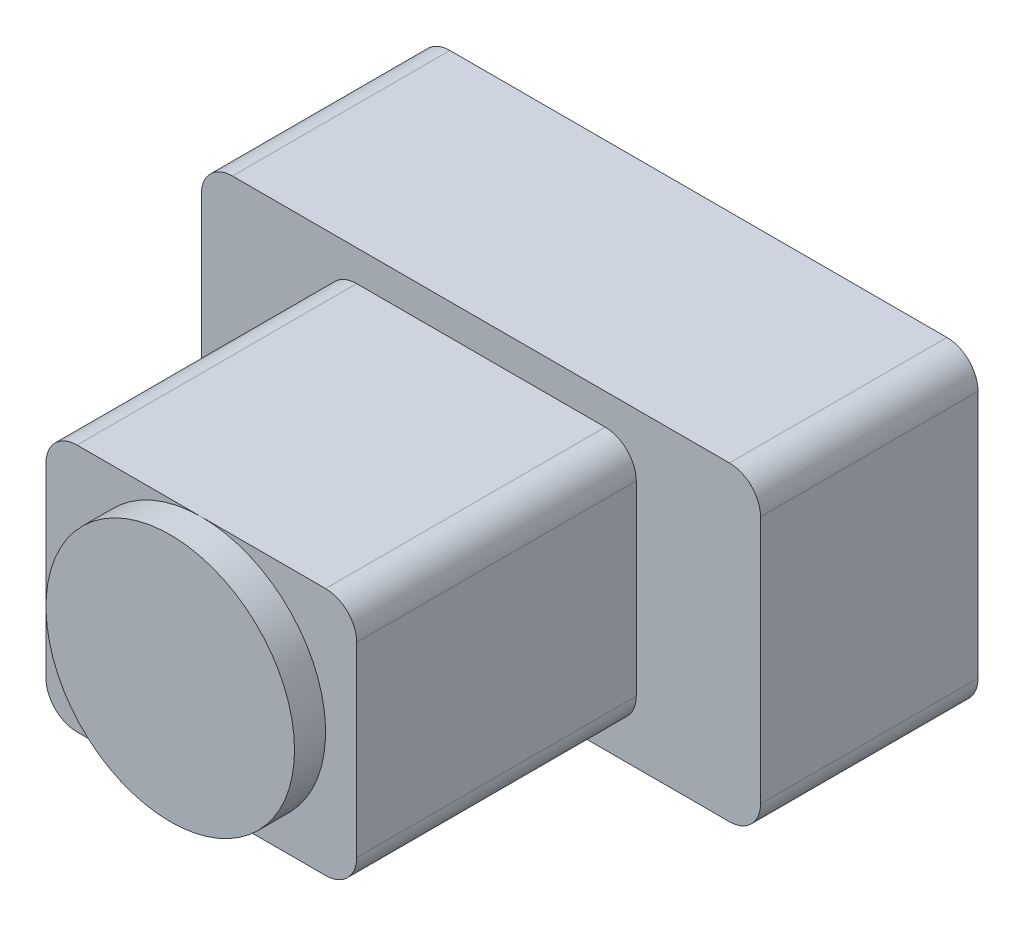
ISO-10303-21;
HEADER;
FILE_DESCRIPTION(('STEP AP214'),'2;1');
FILE_NAME('part.step','',(''),(''),'','','');
FILE_SCHEMA(('AUTOMOTIVE_DESIGN { 1 0 10303 214 1 1 1 1 }'));
ENDSEC;
DATA;
#1=APPLICATION_CONTEXT('core data for automotive mechanical design processes');
#2=APPLICATION_PROTOCOL_DEFINITION('international standard','automotive_design',2000,#1);
#3=PRODUCT_CONTEXT('',#1,'mechanical');
#4=PRODUCT('Part','Part','',(#3));
#5=PRODUCT_RELATED_PRODUCT_CATEGORY('part','',(#4));
#6=PRODUCT_DEFINITION_FORMATION('','',#4);
#7=PRODUCT_DEFINITION_CONTEXT('part definition',#1,'design');
#8=PRODUCT_DEFINITION('design','',#6,#7);
#9=PRODUCT_DEFINITION_SHAPE('','',#8);
#10=(LENGTH_UNIT() NAMED_UNIT(*) SI_UNIT(.MILLI.,.METRE.));
#11=(NAMED_UNIT(*) PLANE_ANGLE_UNIT() SI_UNIT($,.RADIAN.));
#12=(NAMED_UNIT(*) SI_UNIT($,.STERADIAN.) SOLID_ANGLE_UNIT());
#13=UNCERTAINTY_MEASURE_WITH_UNIT(LENGTH_MEASURE(1.E-05),#10,'distance_accuracy_value','');
#14=(GEOMETRIC_REPRESENTATION_CONTEXT(3) GLOBAL_UNCERTAINTY_ASSIGNED_CONTEXT((#13)) GLOBAL_UNIT_ASSIGNED_CONTEXT((#10,
#11,#12)) REPRESENTATION_CONTEXT('',''));
#15=CARTESIAN_POINT('',(0.,0.,0.));
#16=DIRECTION('',(0.,0.,1.));
#17=DIRECTION('',(1.,0.,0.));
#18=AXIS2_PLACEMENT_3D('',#15,#16,#17);
#19=CARTESIAN_POINT('',(-20.,-15.,80.));
#20=DIRECTION('',(0.,0.,1.));
#21=DIRECTION('',(1.,0.,0.));
#22=AXIS2_PLACEMENT_3D('',#19,#20,#21);
#23=PLANE('',#22);
#24=CARTESIAN_POINT('',(0.,0.,80.));
#25=DIRECTION('',(0.,0.,1.));
#26=DIRECTION('',(1.,0.,0.));
#27=AXIS2_PLACEMENT_3D('',#24,#25,#26);
#28=CIRCLE('',#27,20.);
#29=CARTESIAN_POINT('',(0.,20.,80.));
#30=VERTEX_POINT('',#29);
#31=CARTESIAN_POINT('',(0.,-20.,80.));
#32=VERTEX_POINT('',#31);
#33=EDGE_CURVE('E45',#30,#32,#28,.T.);
#34=ORIENTED_EDGE('',*,*,#33,.F.);
#35=DIRECTION('',(-1.,0.,0.));
#36=VECTOR('',#35,1.);
#37=CARTESIAN_POINT('',(-20.,20.,80.));
#38=LINE('',#37,#36);
#39=CARTESIAN_POINT('',(-20.,20.,80.));
#40=VERTEX_POINT('',#39);
#41=EDGE_CURVE('E161',#30,#40,#38,.T.);
#42=ORIENTED_EDGE('',*,*,#41,.T.);
#43=CARTESIAN_POINT('',(-20.,15.,80.));
#44=DIRECTION('',(0.,0.,1.));
#45=DIRECTION('',(1.,0.,0.));
#46=AXIS2_PLACEMENT_3D('',#43,#44,#45);
#47=CIRCLE('',#46,5.);
#48=CARTESIAN_POINT('',(-25.,15.,80.));
#49=VERTEX_POINT('',#48);
#50=EDGE_CURVE('E160',#40,#49,#47,.T.);
#51=ORIENTED_EDGE('',*,*,#50,.T.);
#52=DIRECTION('',(0.,-1.,0.));
#53=VECTOR('',#52,1.);
#54=CARTESIAN_POINT('',(-25.,15.,80.));
#55=LINE('',#54,#53);
#56=CARTESIAN_POINT('',(-25.,-15.,80.));
#57=VERTEX_POINT('',#56);
#58=EDGE_CURVE('E364',#49,#57,#55,.T.);
#59=ORIENTED_EDGE('',*,*,#58,.T.);
#60=CARTESIAN_POINT('',(-20.,-15.,80.));
#61=DIRECTION('',(0.,0.,1.));
#62=DIRECTION('',(1.,0.,0.));
#63=AXIS2_PLACEMENT_3D('',#60,#61,#62);
#64=CIRCLE('',#63,5.);
#65=CARTESIAN_POINT('',(-20.,-20.,80.));
#66=VERTEX_POINT('',#65);
#67=EDGE_CURVE('E361',#57,#66,#64,.T.);
#68=ORIENTED_EDGE('',*,*,#67,.T.);
#69=DIRECTION('',(1.,0.,0.));
#70=VECTOR('',#69,1.);
#71=CARTESIAN_POINT('',(-20.,-20.,80.));
#72=LINE('',#71,#70);
#73=EDGE_CURVE('E174',#66,#32,#72,.T.);
#74=ORIENTED_EDGE('',*,*,#73,.T.);
#75=EDGE_LOOP('',(#34,#42,#51,#59,#68,#74));
#76=FACE_BOUND('',#75,.T.);
#77=ADVANCED_FACE('F35',(#76),#23,.T.);
#78=CARTESIAN_POINT('',(40.,20.,35.));
#79=DIRECTION('',(0.,0.,-1.));
#80=DIRECTION('',(-1.,0.,0.));
#81=AXIS2_PLACEMENT_3D('',#78,#79,#80);
#82=PLANE('',#81);
#83=CARTESIAN_POINT('',(40.,20.,35.));
#84=DIRECTION('',(0.,0.,1.));
#85=DIRECTION('',(-1.,0.,0.));
#86=AXIS2_PLACEMENT_3D('',#83,#84,#85);
#87=CIRCLE('',#86,5.);
#88=CARTESIAN_POINT('',(45.,20.,35.));
#89=VERTEX_POINT('',#88);
#90=CARTESIAN_POINT('',(40.,25.,35.));
#91=VERTEX_POINT('',#90);
#92=EDGE_CURVE('E294',#89,#91,#87,.T.);
#93=ORIENTED_EDGE('',*,*,#92,.T.);
#94=DIRECTION('',(-1.,0.,0.));
#95=VECTOR('',#94,1.);
#96=CARTESIAN_POINT('',(-40.,25.,35.));
#97=LINE('',#96,#95);
#98=CARTESIAN_POINT('',(-40.,25.,35.));
#99=VERTEX_POINT('',#98);
#100=EDGE_CURVE('E319',#91,#99,#97,.T.);
#101=ORIENTED_EDGE('',*,*,#100,.T.);
#102=CARTESIAN_POINT('',(-40.,20.,35.));
#103=DIRECTION('',(0.,0.,1.));
#104=DIRECTION('',(1.,0.,0.));
#105=AXIS2_PLACEMENT_3D('',#102,#103,#104);
#106=CIRCLE('',#105,5.);
#107=CARTESIAN_POINT('',(-45.,20.,35.));
#108=VERTEX_POINT('',#107);
#109=EDGE_CURVE('E277',#99,#108,#106,.T.);
#110=ORIENTED_EDGE('',*,*,#109,.T.);
#111=DIRECTION('',(0.,-1.,0.));
#112=VECTOR('',#111,1.);
#113=CARTESIAN_POINT('',(-45.,20.,35.));
#114=LINE('',#113,#112);
#115=CARTESIAN_POINT('',(-45.,-20.,35.));
#116=VERTEX_POINT('',#115);
#117=EDGE_CURVE('E313',#108,#116,#114,.T.);
#118=ORIENTED_EDGE('',*,*,#117,.T.);
#119=CARTESIAN_POINT('',(-40.,-20.,35.));
#120=DIRECTION('',(0.,0.,1.));
#121=DIRECTION('',(1.,0.,0.));
#122=AXIS2_PLACEMENT_3D('',#119,#120,#121);
#123=CIRCLE('',#122,5.);
#124=CARTESIAN_POINT('',(-40.,-25.,35.));
#125=VERTEX_POINT('',#124);
#126=EDGE_CURVE('E315',#116,#125,#123,.T.);
#127=ORIENTED_EDGE('',*,*,#126,.T.);
#128=DIRECTION('',(1.,0.,0.));
#129=VECTOR('',#128,1.);
#130=CARTESIAN_POINT('',(-40.,-25.,35.));
#131=LINE('',#130,#129);
#132=CARTESIAN_POINT('',(40.,-25.,35.));
#133=VERTEX_POINT('',#132);
#134=EDGE_CURVE('E317',#125,#133,#131,.T.);
#135=ORIENTED_EDGE('',*,*,#134,.T.);
#136=CARTESIAN_POINT('',(40.,-20.,35.));
#137=DIRECTION('',(0.,0.,1.));
#138=DIRECTION('',(1.,0.,0.));
#139=AXIS2_PLACEMENT_3D('',#136,#137,#138);
#140=CIRCLE('',#139,5.);
#141=CARTESIAN_POINT('',(45.,-20.,35.));
#142=VERTEX_POINT('',#141);
#143=EDGE_CURVE('E324',#133,#142,#140,.T.);
#144=ORIENTED_EDGE('',*,*,#143,.T.);
#145=DIRECTION('',(0.,1.,0.));
#146=VECTOR('',#145,1.);
#147=CARTESIAN_POINT('',(45.,20.,35.));
#148=LINE('',#147,#146);
#149=EDGE_CURVE('E299',#142,#89,#148,.T.);
#150=ORIENTED_EDGE('',*,*,#149,.T.);
#151=EDGE_LOOP('',(#93,#101,#110,#118,#127,#135,#144,#150));
#152=FACE_BOUND('',#151,.T.);
#153=CARTESIAN_POINT('',(-20.,-15.,35.));
#154=DIRECTION('',(0.,0.,1.));
#155=DIRECTION('',(1.,0.,0.));
#156=AXIS2_PLACEMENT_3D('',#153,#154,#155);
#157=CIRCLE('',#156,5.);
#158=CARTESIAN_POINT('',(-25.,-15.,35.));
#159=VERTEX_POINT('',#158);
#160=CARTESIAN_POINT('',(-20.,-20.,35.));
#161=VERTEX_POINT('',#160);
#162=EDGE_CURVE('E348',#159,#161,#157,.T.);
#163=ORIENTED_EDGE('',*,*,#162,.F.);
#164=DIRECTION('',(0.,-1.,0.));
#165=VECTOR('',#164,1.);
#166=CARTESIAN_POINT('',(-25.,15.,35.));
#167=LINE('',#166,#165);
#168=CARTESIAN_POINT('',(-25.,15.,35.));
#169=VERTEX_POINT('',#168);
#170=EDGE_CURVE('E350',#169,#159,#167,.T.);
#171=ORIENTED_EDGE('',*,*,#170,.F.);
#172=CARTESIAN_POINT('',(-20.,15.,35.));
#173=DIRECTION('',(0.,0.,1.));
#174=DIRECTION('',(1.,0.,0.));
#175=AXIS2_PLACEMENT_3D('',#172,#173,#174);
#176=CIRCLE('',#175,5.);
#177=CARTESIAN_POINT('',(-20.,20.,35.));
#178=VERTEX_POINT('',#177);
#179=EDGE_CURVE('E362',#178,#169,#176,.T.);
#180=ORIENTED_EDGE('',*,*,#179,.F.);
#181=DIRECTION('',(-1.,0.,0.));
#182=VECTOR('',#181,1.);
#183=CARTESIAN_POINT('',(-20.,20.,35.));
#184=LINE('',#183,#182);
#185=CARTESIAN_POINT('',(20.,20.,35.));
#186=VERTEX_POINT('',#185);
#187=EDGE_CURVE('E394',#186,#178,#184,.T.);
#188=ORIENTED_EDGE('',*,*,#187,.F.);
#189=CARTESIAN_POINT('',(20.,15.,35.));
#190=DIRECTION('',(0.,0.,1.));
#191=DIRECTION('',(-1.,0.,0.));
#192=AXIS2_PLACEMENT_3D('',#189,#190,#191);
#193=CIRCLE('',#192,5.);
#194=CARTESIAN_POINT('',(25.,15.,35.));
#195=VERTEX_POINT('',#194);
#196=EDGE_CURVE('E388',#195,#186,#193,.T.);
#197=ORIENTED_EDGE('',*,*,#196,.F.);
#198=DIRECTION('',(0.,1.,0.));
#199=VECTOR('',#198,1.);
#200=CARTESIAN_POINT('',(25.,15.,35.));
#201=LINE('',#200,#199);
#202=CARTESIAN_POINT('',(25.,-15.,35.));
#203=VERTEX_POINT('',#202);
#204=EDGE_CURVE('E380',#203,#195,#201,.T.);
#205=ORIENTED_EDGE('',*,*,#204,.F.);
#206=CARTESIAN_POINT('',(20.,-15.,35.));
#207=DIRECTION('',(0.,0.,1.));
#208=DIRECTION('',(1.,0.,0.));
#209=AXIS2_PLACEMENT_3D('',#206,#207,#208);
#210=CIRCLE('',#209,5.);
#211=CARTESIAN_POINT('',(20.,-20.,35.));
#212=VERTEX_POINT('',#211);
#213=EDGE_CURVE('E385',#212,#203,#210,.T.);
#214=ORIENTED_EDGE('',*,*,#213,.F.);
#215=DIRECTION('',(1.,0.,0.));
#216=VECTOR('',#215,1.);
#217=CARTESIAN_POINT('',(-20.,-20.,35.));
#218=LINE('',#217,#216);
#219=EDGE_CURVE('E58',#161,#212,#218,.T.);
#220=ORIENTED_EDGE('',*,*,#219,.F.);
#221=EDGE_LOOP('',(#163,#171,#180,#188,#197,#205,#214,#220));
#222=FACE_BOUND('',#221,.T.);
#223=ADVANCED_FACE('F192',(#152,#222),#82,.F.);
#224=CARTESIAN_POINT('',(40.,20.,35.));
#225=DIRECTION('',(0.,0.,-1.));
#226=DIRECTION('',(-1.,0.,0.));
#227=AXIS2_PLACEMENT_3D('',#224,#225,#226);
#228=CYLINDRICAL_SURFACE('',#227,5.);
#229=CARTESIAN_POINT('',(40.,20.,0.));
#230=DIRECTION('',(0.,0.,1.));
#231=DIRECTION('',(-1.,0.,0.));
#232=AXIS2_PLACEMENT_3D('',#229,#230,#231);
#233=CIRCLE('',#232,5.);
#234=CARTESIAN_POINT('',(45.,20.,0.));
#235=VERTEX_POINT('',#234);
#236=CARTESIAN_POINT('',(40.,25.,0.));
#237=VERTEX_POINT('',#236);
#238=EDGE_CURVE('E273',#235,#237,#233,.T.);
#239=ORIENTED_EDGE('',*,*,#238,.T.);
#240=DIRECTION('',(0.,0.,-1.));
#241=VECTOR('',#240,1.);
#242=CARTESIAN_POINT('',(40.,25.,35.));
#243=LINE('',#242,#241);
#244=EDGE_CURVE('E39',#91,#237,#243,.T.);
#245=ORIENTED_EDGE('',*,*,#244,.F.);
#246=ORIENTED_EDGE('',*,*,#92,.F.);
#247=DIRECTION('',(0.,0.,-1.));
#248=VECTOR('',#247,1.);
#249=CARTESIAN_POINT('',(45.,20.,35.));
#250=LINE('',#249,#248);
#251=EDGE_CURVE('E295',#89,#235,#250,.T.);
#252=ORIENTED_EDGE('',*,*,#251,.T.);
#253=EDGE_LOOP('',(#239,#245,#246,#252));
#254=FACE_BOUND('',#253,.T.);
#255=ADVANCED_FACE('F37',(#254),#228,.T.);
#256=CARTESIAN_POINT('',(-40.,25.,35.));
#257=DIRECTION('',(0.,-1.,0.));
#258=DIRECTION('',(0.,0.,-1.));
#259=AXIS2_PLACEMENT_3D('',#256,#257,#258);
#260=PLANE('',#259);
#261=DIRECTION('',(-1.,0.,0.));
#262=VECTOR('',#261,1.);
#263=CARTESIAN_POINT('',(-40.,25.,0.));
#264=LINE('',#263,#262);
#265=CARTESIAN_POINT('',(-40.,25.,0.));
#266=VERTEX_POINT('',#265);
#267=EDGE_CURVE('E264',#237,#266,#264,.T.);
#268=ORIENTED_EDGE('',*,*,#267,.T.);
#269=DIRECTION('',(0.,0.,-1.));
#270=VECTOR('',#269,1.);
#271=CARTESIAN_POINT('',(-40.,25.,35.));
#272=LINE('',#271,#270);
#273=EDGE_CURVE('E266',#99,#266,#272,.T.);
#274=ORIENTED_EDGE('',*,*,#273,.F.);
#275=ORIENTED_EDGE('',*,*,#100,.F.);
#276=ORIENTED_EDGE('',*,*,#244,.T.);
#277=EDGE_LOOP('',(#268,#274,#275,#276));
#278=FACE_BOUND('',#277,.T.);
#279=ADVANCED_FACE('F254',(#278),#260,.F.);
#280=CARTESIAN_POINT('',(-40.,20.,35.));
#281=DIRECTION('',(0.,0.,-1.));
#282=DIRECTION('',(-1.,0.,0.));
#283=AXIS2_PLACEMENT_3D('',#280,#281,#282);
#284=CYLINDRICAL_SURFACE('',#283,5.);
#285=CARTESIAN_POINT('',(-40.,20.,0.));
#286=DIRECTION('',(0.,0.,1.));
#287=DIRECTION('',(1.,0.,0.));
#288=AXIS2_PLACEMENT_3D('',#285,#286,#287);
#289=CIRCLE('',#288,5.);
#290=CARTESIAN_POINT('',(-45.,20.,0.));
#291=VERTEX_POINT('',#290);
#292=EDGE_CURVE('E272',#266,#291,#289,.T.);
#293=ORIENTED_EDGE('',*,*,#292,.T.);
#294=DIRECTION('',(0.,0.,-1.));
#295=VECTOR('',#294,1.);
#296=CARTESIAN_POINT('',(-45.,20.,35.));
#297=LINE('',#296,#295);
#298=EDGE_CURVE('E278',#108,#291,#297,.T.);
#299=ORIENTED_EDGE('',*,*,#298,.F.);
#300=ORIENTED_EDGE('',*,*,#109,.F.);
#301=ORIENTED_EDGE('',*,*,#273,.T.);
#302=EDGE_LOOP('',(#293,#299,#300,#301));
#303=FACE_BOUND('',#302,.T.);
#304=ADVANCED_FACE('F251',(#303),#284,.T.);
#305=CARTESIAN_POINT('',(-45.,20.,35.));
#306=DIRECTION('',(1.,0.,0.));
#307=DIRECTION('',(0.,1.,0.));
#308=AXIS2_PLACEMENT_3D('',#305,#306,#307);
#309=PLANE('',#308);
#310=DIRECTION('',(0.,-1.,0.));
#311=VECTOR('',#310,1.);
#312=CARTESIAN_POINT('',(-45.,20.,0.));
#313=LINE('',#312,#311);
#314=CARTESIAN_POINT('',(-45.,-20.,0.));
#315=VERTEX_POINT('',#314);
#316=EDGE_CURVE('E281',#291,#315,#313,.T.);
#317=ORIENTED_EDGE('',*,*,#316,.T.);
#318=DIRECTION('',(0.,0.,-1.));
#319=VECTOR('',#318,1.);
#320=CARTESIAN_POINT('',(-45.,-20.,35.));
#321=LINE('',#320,#319);
#322=EDGE_CURVE('E308',#116,#315,#321,.T.);
#323=ORIENTED_EDGE('',*,*,#322,.F.);
#324=ORIENTED_EDGE('',*,*,#117,.F.);
#325=ORIENTED_EDGE('',*,*,#298,.T.);
#326=EDGE_LOOP('',(#317,#323,#324,#325));
#327=FACE_BOUND('',#326,.T.);
#328=ADVANCED_FACE('F247',(#327),#309,.F.);
#329=CARTESIAN_POINT('',(-40.,-20.,35.));
#330=DIRECTION('',(0.,0.,-1.));
#331=DIRECTION('',(-1.,0.,0.));
#332=AXIS2_PLACEMENT_3D('',#329,#330,#331);
#333=CYLINDRICAL_SURFACE('',#332,5.);
#334=CARTESIAN_POINT('',(-40.,-20.,0.));
#335=DIRECTION('',(0.,0.,1.));
#336=DIRECTION('',(1.,0.,0.));
#337=AXIS2_PLACEMENT_3D('',#334,#335,#336);
#338=CIRCLE('',#337,5.);
#339=CARTESIAN_POINT('',(-40.,-25.,0.));
#340=VERTEX_POINT('',#339);
#341=EDGE_CURVE('E283',#315,#340,#338,.T.);
#342=ORIENTED_EDGE('',*,*,#341,.T.);
#343=DIRECTION('',(0.,0.,-1.));
#344=VECTOR('',#343,1.);
#345=CARTESIAN_POINT('',(-40.,-25.,35.));
#346=LINE('',#345,#344);
#347=EDGE_CURVE('E305',#125,#340,#346,.T.);
#348=ORIENTED_EDGE('',*,*,#347,.F.);
#349=ORIENTED_EDGE('',*,*,#126,.F.);
#350=ORIENTED_EDGE('',*,*,#322,.T.);
#351=EDGE_LOOP('',(#342,#348,#349,#350));
#352=FACE_BOUND('',#351,.T.);
#353=ADVANCED_FACE('F243',(#352),#333,.T.);
#354=CARTESIAN_POINT('',(-40.,-25.,35.));
#355=DIRECTION('',(0.,1.,0.));
#356=DIRECTION('',(0.,0.,1.));
#357=AXIS2_PLACEMENT_3D('',#354,#355,#356);
#358=PLANE('',#357);
#359=DIRECTION('',(1.,0.,0.));
#360=VECTOR('',#359,1.);
#361=CARTESIAN_POINT('',(-40.,-25.,0.));
#362=LINE('',#361,#360);
#363=CARTESIAN_POINT('',(40.,-25.,0.));
#364=VERTEX_POINT('',#363);
#365=EDGE_CURVE('E288',#340,#364,#362,.T.);
#366=ORIENTED_EDGE('',*,*,#365,.T.);
#367=DIRECTION('',(0.,0.,-1.));
#368=VECTOR('',#367,1.);
#369=CARTESIAN_POINT('',(40.,-25.,35.));
#370=LINE('',#369,#368);
#371=EDGE_CURVE('E302',#133,#364,#370,.T.);
#372=ORIENTED_EDGE('',*,*,#371,.F.);
#373=ORIENTED_EDGE('',*,*,#134,.F.);
#374=ORIENTED_EDGE('',*,*,#347,.T.);
#375=EDGE_LOOP('',(#366,#372,#373,#374));
#376=FACE_BOUND('',#375,.T.);
#377=ADVANCED_FACE('F239',(#376),#358,.F.);
#378=CARTESIAN_POINT('',(40.,-20.,35.));
#379=DIRECTION('',(0.,0.,-1.));
#380=DIRECTION('',(-1.,0.,0.));
#381=AXIS2_PLACEMENT_3D('',#378,#379,#380);
#382=CYLINDRICAL_SURFACE('',#381,5.);
#383=CARTESIAN_POINT('',(40.,-20.,0.));
#384=DIRECTION('',(0.,0.,1.));
#385=DIRECTION('',(1.,0.,0.));
#386=AXIS2_PLACEMENT_3D('',#383,#384,#385);
#387=CIRCLE('',#386,5.);
#388=CARTESIAN_POINT('',(45.,-20.,0.));
#389=VERTEX_POINT('',#388);
#390=EDGE_CURVE('E290',#364,#389,#387,.T.);
#391=ORIENTED_EDGE('',*,*,#390,.T.);
#392=DIRECTION('',(0.,0.,-1.));
#393=VECTOR('',#392,1.);
#394=CARTESIAN_POINT('',(45.,-20.,35.));
#395=LINE('',#394,#393);
#396=EDGE_CURVE('E298',#142,#389,#395,.T.);
#397=ORIENTED_EDGE('',*,*,#396,.F.);
#398=ORIENTED_EDGE('',*,*,#143,.F.);
#399=ORIENTED_EDGE('',*,*,#371,.T.);
#400=EDGE_LOOP('',(#391,#397,#398,#399));
#401=FACE_BOUND('',#400,.T.);
#402=ADVANCED_FACE('F235',(#401),#382,.T.);
#403=CARTESIAN_POINT('',(45.,20.,35.));
#404=DIRECTION('',(-1.,0.,0.));
#405=DIRECTION('',(0.,-1.,0.));
#406=AXIS2_PLACEMENT_3D('',#403,#404,#405);
#407=PLANE('',#406);
#408=DIRECTION('',(0.,1.,0.));
#409=VECTOR('',#408,1.);
#410=CARTESIAN_POINT('',(45.,20.,0.));
#411=LINE('',#410,#409);
#412=EDGE_CURVE('E292',#389,#235,#411,.T.);
#413=ORIENTED_EDGE('',*,*,#412,.T.);
#414=ORIENTED_EDGE('',*,*,#251,.F.);
#415=ORIENTED_EDGE('',*,*,#149,.F.);
#416=ORIENTED_EDGE('',*,*,#396,.T.);
#417=EDGE_LOOP('',(#413,#414,#415,#416));
#418=FACE_BOUND('',#417,.T.);
#419=ADVANCED_FACE('F231',(#418),#407,.F.);
#420=CARTESIAN_POINT('',(40.,20.,0.));
#421=DIRECTION('',(0.,0.,-1.));
#422=DIRECTION('',(-1.,0.,0.));
#423=AXIS2_PLACEMENT_3D('',#420,#421,#422);
#424=PLANE('',#423);
#425=ORIENTED_EDGE('',*,*,#238,.F.);
#426=ORIENTED_EDGE('',*,*,#412,.F.);
#427=ORIENTED_EDGE('',*,*,#390,.F.);
#428=ORIENTED_EDGE('',*,*,#365,.F.);
#429=ORIENTED_EDGE('',*,*,#341,.F.);
#430=ORIENTED_EDGE('',*,*,#316,.F.);
#431=ORIENTED_EDGE('',*,*,#292,.F.);
#432=ORIENTED_EDGE('',*,*,#267,.F.);
#433=EDGE_LOOP('',(#425,#426,#427,#428,#429,#430,#431,#432));
#434=FACE_BOUND('',#433,.T.);
#435=ADVANCED_FACE('F226',(#434),#424,.T.);
#436=CARTESIAN_POINT('',(-20.,-15.,80.));
#437=DIRECTION('',(0.,0.,-1.));
#438=DIRECTION('',(-1.,0.,0.));
#439=AXIS2_PLACEMENT_3D('',#436,#437,#438);
#440=CYLINDRICAL_SURFACE('',#439,5.);
#441=ORIENTED_EDGE('',*,*,#162,.T.);
#442=DIRECTION('',(0.,0.,-1.));
#443=VECTOR('',#442,1.);
#444=CARTESIAN_POINT('',(-20.,-20.,80.));
#445=LINE('',#444,#443);
#446=EDGE_CURVE('E326',#66,#161,#445,.T.);
#447=ORIENTED_EDGE('',*,*,#446,.F.);
#448=ORIENTED_EDGE('',*,*,#67,.F.);
#449=DIRECTION('',(0.,0.,-1.));
#450=VECTOR('',#449,1.);
#451=CARTESIAN_POINT('',(-25.,-15.,80.));
#452=LINE('',#451,#450);
#453=EDGE_CURVE('E357',#57,#159,#452,.T.);
#454=ORIENTED_EDGE('',*,*,#453,.T.);
#455=EDGE_LOOP('',(#441,#447,#448,#454));
#456=FACE_BOUND('',#455,.T.);
#457=ADVANCED_FACE('F223',(#456),#440,.T.);
#458=CARTESIAN_POINT('',(-20.,-20.,80.));
#459=DIRECTION('',(0.,1.,0.));
#460=DIRECTION('',(-1.,0.,0.));
#461=AXIS2_PLACEMENT_3D('',#458,#459,#460);
#462=PLANE('',#461);
#463=ORIENTED_EDGE('',*,*,#219,.T.);
#464=DIRECTION('',(0.,0.,-1.));
#465=VECTOR('',#464,1.);
#466=CARTESIAN_POINT('',(20.,-20.,80.));
#467=LINE('',#466,#465);
#468=CARTESIAN_POINT('',(20.,-20.,80.));
#469=VERTEX_POINT('',#468);
#470=EDGE_CURVE('E327',#469,#212,#467,.T.);
#471=ORIENTED_EDGE('',*,*,#470,.F.);
#472=EDGE_CURVE('E399',#32,#469,#72,.T.);
#473=ORIENTED_EDGE('',*,*,#472,.F.);
#474=ORIENTED_EDGE('',*,*,#73,.F.);
#475=ORIENTED_EDGE('',*,*,#446,.T.);
#476=EDGE_LOOP('',(#463,#471,#473,#474,#475));
#477=FACE_BOUND('',#476,.T.);
#478=ADVANCED_FACE('F219',(#477),#462,.F.);
#479=CARTESIAN_POINT('',(20.,-15.,80.));
#480=DIRECTION('',(0.,0.,-1.));
#481=DIRECTION('',(-1.,0.,0.));
#482=AXIS2_PLACEMENT_3D('',#479,#480,#481);
#483=CYLINDRICAL_SURFACE('',#482,5.);
#484=ORIENTED_EDGE('',*,*,#213,.T.);
#485=DIRECTION('',(0.,0.,-1.));
#486=VECTOR('',#485,1.);
#487=CARTESIAN_POINT('',(25.,-15.,80.));
#488=LINE('',#487,#486);
#489=CARTESIAN_POINT('',(25.,-15.,80.));
#490=VERTEX_POINT('',#489);
#491=EDGE_CURVE('E332',#490,#203,#488,.T.);
#492=ORIENTED_EDGE('',*,*,#491,.F.);
#493=CARTESIAN_POINT('',(20.,-15.,80.));
#494=DIRECTION('',(0.,0.,1.));
#495=DIRECTION('',(1.,0.,0.));
#496=AXIS2_PLACEMENT_3D('',#493,#494,#495);
#497=CIRCLE('',#496,5.);
#498=EDGE_CURVE('E384',#469,#490,#497,.T.);
#499=ORIENTED_EDGE('',*,*,#498,.F.);
#500=ORIENTED_EDGE('',*,*,#470,.T.);
#501=EDGE_LOOP('',(#484,#492,#499,#500));
#502=FACE_BOUND('',#501,.T.);
#503=ADVANCED_FACE('F215',(#502),#483,.T.);
#504=CARTESIAN_POINT('',(25.,15.,80.));
#505=DIRECTION('',(-1.,0.,0.));
#506=DIRECTION('',(0.,-1.,0.));
#507=AXIS2_PLACEMENT_3D('',#504,#505,#506);
#508=PLANE('',#507);
#509=ORIENTED_EDGE('',*,*,#204,.T.);
#510=DIRECTION('',(0.,0.,-1.));
#511=VECTOR('',#510,1.);
#512=CARTESIAN_POINT('',(25.,15.,80.));
#513=LINE('',#512,#511);
#514=CARTESIAN_POINT('',(25.,15.,80.));
#515=VERTEX_POINT('',#514);
#516=EDGE_CURVE('E373',#515,#195,#513,.T.);
#517=ORIENTED_EDGE('',*,*,#516,.F.);
#518=DIRECTION('',(0.,1.,0.));
#519=VECTOR('',#518,1.);
#520=CARTESIAN_POINT('',(25.,15.,80.));
#521=LINE('',#520,#519);
#522=EDGE_CURVE('E381',#490,#515,#521,.T.);
#523=ORIENTED_EDGE('',*,*,#522,.F.);
#524=ORIENTED_EDGE('',*,*,#491,.T.);
#525=EDGE_LOOP('',(#509,#517,#523,#524));
#526=FACE_BOUND('',#525,.T.);
#527=ADVANCED_FACE('F211',(#526),#508,.F.);
#528=CARTESIAN_POINT('',(20.,15.,80.));
#529=DIRECTION('',(0.,0.,-1.));
#530=DIRECTION('',(-1.,0.,0.));
#531=AXIS2_PLACEMENT_3D('',#528,#529,#530);
#532=CYLINDRICAL_SURFACE('',#531,5.);
#533=ORIENTED_EDGE('',*,*,#196,.T.);
#534=DIRECTION('',(0.,0.,-1.));
#535=VECTOR('',#534,1.);
#536=CARTESIAN_POINT('',(20.,20.,80.));
#537=LINE('',#536,#535);
#538=CARTESIAN_POINT('',(20.,20.,80.));
#539=VERTEX_POINT('',#538);
#540=EDGE_CURVE('E371',#539,#186,#537,.T.);
#541=ORIENTED_EDGE('',*,*,#540,.F.);
#542=CARTESIAN_POINT('',(20.,15.,80.));
#543=DIRECTION('',(0.,0.,1.));
#544=DIRECTION('',(-1.,0.,0.));
#545=AXIS2_PLACEMENT_3D('',#542,#543,#544);
#546=CIRCLE('',#545,5.);
#547=EDGE_CURVE('E156',#515,#539,#546,.T.);
#548=ORIENTED_EDGE('',*,*,#547,.F.);
#549=ORIENTED_EDGE('',*,*,#516,.T.);
#550=EDGE_LOOP('',(#533,#541,#548,#549));
#551=FACE_BOUND('',#550,.T.);
#552=ADVANCED_FACE('F208',(#551),#532,.T.);
#553=CARTESIAN_POINT('',(-20.,20.,80.));
#554=DIRECTION('',(0.,-1.,0.));
#555=DIRECTION('',(1.,0.,0.));
#556=AXIS2_PLACEMENT_3D('',#553,#554,#555);
#557=PLANE('',#556);
#558=ORIENTED_EDGE('',*,*,#187,.T.);
#559=DIRECTION('',(0.,0.,-1.));
#560=VECTOR('',#559,1.);
#561=CARTESIAN_POINT('',(-20.,20.,80.));
#562=LINE('',#561,#560);
#563=EDGE_CURVE('E168',#40,#178,#562,.T.);
#564=ORIENTED_EDGE('',*,*,#563,.F.);
#565=ORIENTED_EDGE('',*,*,#41,.F.);
#566=EDGE_CURVE('E152',#539,#30,#38,.T.);
#567=ORIENTED_EDGE('',*,*,#566,.F.);
#568=ORIENTED_EDGE('',*,*,#540,.T.);
#569=EDGE_LOOP('',(#558,#564,#565,#567,#568));
#570=FACE_BOUND('',#569,.T.);
#571=ADVANCED_FACE('F166',(#570),#557,.F.);
#572=CARTESIAN_POINT('',(-20.,15.,80.));
#573=DIRECTION('',(0.,0.,-1.));
#574=DIRECTION('',(-1.,0.,0.));
#575=AXIS2_PLACEMENT_3D('',#572,#573,#574);
#576=CYLINDRICAL_SURFACE('',#575,5.);
#577=ORIENTED_EDGE('',*,*,#179,.T.);
#578=DIRECTION('',(0.,0.,-1.));
#579=VECTOR('',#578,1.);
#580=CARTESIAN_POINT('',(-25.,15.,80.));
#581=LINE('',#580,#579);
#582=EDGE_CURVE('E360',#49,#169,#581,.T.);
#583=ORIENTED_EDGE('',*,*,#582,.F.);
#584=ORIENTED_EDGE('',*,*,#50,.F.);
#585=ORIENTED_EDGE('',*,*,#563,.T.);
#586=EDGE_LOOP('',(#577,#583,#584,#585));
#587=FACE_BOUND('',#586,.T.);
#588=ADVANCED_FACE('F201',(#587),#576,.T.);
#589=CARTESIAN_POINT('',(-25.,15.,80.));
#590=DIRECTION('',(1.,0.,0.));
#591=DIRECTION('',(0.,1.,0.));
#592=AXIS2_PLACEMENT_3D('',#589,#590,#591);
#593=PLANE('',#592);
#594=ORIENTED_EDGE('',*,*,#170,.T.);
#595=ORIENTED_EDGE('',*,*,#453,.F.);
#596=ORIENTED_EDGE('',*,*,#58,.F.);
#597=ORIENTED_EDGE('',*,*,#582,.T.);
#598=EDGE_LOOP('',(#594,#595,#596,#597));
#599=FACE_BOUND('',#598,.T.);
#600=ADVANCED_FACE('F188',(#599),#593,.F.);
#601=EDGE_CURVE('E11',#32,#30,#28,.T.);
#602=ORIENTED_EDGE('',*,*,#601,.F.);
#603=ORIENTED_EDGE('',*,*,#472,.T.);
#604=ORIENTED_EDGE('',*,*,#498,.T.);
#605=ORIENTED_EDGE('',*,*,#522,.T.);
#606=ORIENTED_EDGE('',*,*,#547,.T.);
#607=ORIENTED_EDGE('',*,*,#566,.T.);
#608=EDGE_LOOP('',(#602,#603,#604,#605,#606,#607));
#609=FACE_BOUND('',#608,.T.);
#610=ADVANCED_FACE('F154',(#609),#23,.T.);
#611=CARTESIAN_POINT('',(0.,0.,85.));
#612=DIRECTION('',(0.,0.,-1.));
#613=DIRECTION('',(-1.,0.,0.));
#614=AXIS2_PLACEMENT_3D('',#611,#612,#613);
#615=CYLINDRICAL_SURFACE('',#614,20.);
#616=CARTESIAN_POINT('',(0.,0.,85.));
#617=DIRECTION('',(0.,0.,1.));
#618=DIRECTION('',(1.,0.,0.));
#619=AXIS2_PLACEMENT_3D('',#616,#617,#618);
#620=CIRCLE('',#619,20.);
#621=CARTESIAN_POINT('',(20.,0.,85.));
#622=VERTEX_POINT('',#621);
#623=EDGE_CURVE('E176',#622,#622,#620,.T.);
#624=ORIENTED_EDGE('',*,*,#623,.F.);
#625=EDGE_LOOP('',(#624));
#626=FACE_BOUND('',#625,.T.);
#627=ORIENTED_EDGE('',*,*,#33,.T.);
#628=ORIENTED_EDGE('',*,*,#601,.T.);
#629=EDGE_LOOP('',(#627,#628));
#630=FACE_BOUND('',#629,.T.);
#631=ADVANCED_FACE('F177',(#626,#630),#615,.T.);
#632=CARTESIAN_POINT('',(0.,0.,85.));
#633=DIRECTION('',(0.,0.,1.));
#634=DIRECTION('',(1.,0.,0.));
#635=AXIS2_PLACEMENT_3D('',#632,#633,#634);
#636=PLANE('',#635);
#637=ORIENTED_EDGE('',*,*,#623,.T.);
#638=EDGE_LOOP('',(#637));
#639=FACE_BOUND('',#638,.T.);
#640=ADVANCED_FACE('F179',(#639),#636,.T.);
#641=CLOSED_SHELL('',(#77,#223,#255,#279,#304,#328,#353,#377,#402,#419,#435,#457,#478,#503,#527,
#552,#571,#588,#600,#610,#631,#640));
#642=MANIFOLD_SOLID_BREP('B2',#641);
#643=ADVANCED_BREP_SHAPE_REPRESENTATION('',(#18,#642),#14);
#644=SHAPE_DEFINITION_REPRESENTATION(#9,#643);
ENDSEC;
END-ISO-10303-21;
